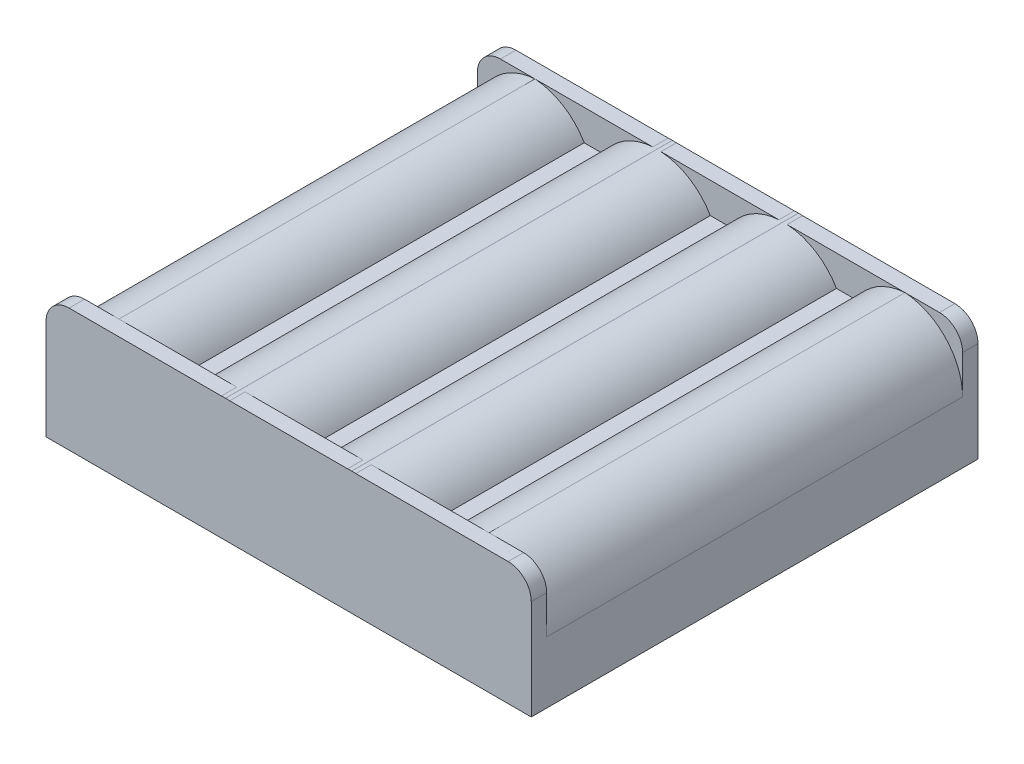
ISO-10303-21;
HEADER;
FILE_DESCRIPTION(('STEP AP214'),'2;1');
FILE_NAME('part.step','',(''),(''),'','','');
FILE_SCHEMA(('AUTOMOTIVE_DESIGN { 1 0 10303 214 1 1 1 1 }'));
ENDSEC;
DATA;
#1=APPLICATION_CONTEXT('core data for automotive mechanical design processes');
#2=APPLICATION_PROTOCOL_DEFINITION('international standard','automotive_design',2000,#1);
#3=PRODUCT_CONTEXT('',#1,'mechanical');
#4=PRODUCT('Part','Part','',(#3));
#5=PRODUCT_RELATED_PRODUCT_CATEGORY('part','',(#4));
#6=PRODUCT_DEFINITION_FORMATION('','',#4);
#7=PRODUCT_DEFINITION_CONTEXT('part definition',#1,'design');
#8=PRODUCT_DEFINITION('design','',#6,#7);
#9=PRODUCT_DEFINITION_SHAPE('','',#8);
#10=(LENGTH_UNIT() NAMED_UNIT(*) SI_UNIT(.MILLI.,.METRE.));
#11=(NAMED_UNIT(*) PLANE_ANGLE_UNIT() SI_UNIT($,.RADIAN.));
#12=(NAMED_UNIT(*) SI_UNIT($,.STERADIAN.) SOLID_ANGLE_UNIT());
#13=UNCERTAINTY_MEASURE_WITH_UNIT(LENGTH_MEASURE(1.E-05),#10,'distance_accuracy_value','');
#14=(GEOMETRIC_REPRESENTATION_CONTEXT(3) GLOBAL_UNCERTAINTY_ASSIGNED_CONTEXT((#13)) GLOBAL_UNIT_ASSIGNED_CONTEXT((#10,
#11,#12)) REPRESENTATION_CONTEXT('',''));
#15=CARTESIAN_POINT('',(0.,0.,0.));
#16=DIRECTION('',(0.,0.,1.));
#17=DIRECTION('',(1.,0.,0.));
#18=AXIS2_PLACEMENT_3D('',#15,#16,#17);
#19=CARTESIAN_POINT('',(8.19679676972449,8.,29.));
#20=DIRECTION('',(0.,0.,-1.));
#21=DIRECTION('',(-1.,0.,0.));
#22=AXIS2_PLACEMENT_3D('',#19,#20,#21);
#23=CYLINDRICAL_SURFACE('',#22,8.);
#24=CARTESIAN_POINT('',(8.19679676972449,8.,-27.));
#25=DIRECTION('',(0.,0.,1.));
#26=DIRECTION('',(1.,0.,0.));
#27=AXIS2_PLACEMENT_3D('',#24,#25,#26);
#28=CIRCLE('',#27,8.);
#29=CARTESIAN_POINT('',(8.72339838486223,15.9826493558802,-27.));
#30=VERTEX_POINT('',#29);
#31=CARTESIAN_POINT('',(15.125,12.,-27.));
#32=VERTEX_POINT('',#31);
#33=EDGE_CURVE('E285',#30,#32,#28,.F.);
#34=ORIENTED_EDGE('',*,*,#33,.F.);
#35=DIRECTION('',(0.,0.,-1.));
#36=VECTOR('',#35,1.);
#37=CARTESIAN_POINT('',(8.72339838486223,15.9826493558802,29.));
#38=LINE('',#37,#36);
#39=CARTESIAN_POINT('',(8.72339838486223,15.9826493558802,-29.));
#40=VERTEX_POINT('',#39);
#41=EDGE_CURVE('E268',#30,#40,#38,.T.);
#42=ORIENTED_EDGE('',*,*,#41,.T.);
#43=CARTESIAN_POINT('',(8.19679676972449,8.,-29.));
#44=DIRECTION('',(0.,0.,1.));
#45=DIRECTION('',(1.,0.,0.));
#46=AXIS2_PLACEMENT_3D('',#43,#44,#45);
#47=CIRCLE('',#46,8.);
#48=CARTESIAN_POINT('',(8.19679676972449,16.,-29.));
#49=VERTEX_POINT('',#48);
#50=EDGE_CURVE('E283',#49,#40,#47,.F.);
#51=ORIENTED_EDGE('',*,*,#50,.F.);
#52=DIRECTION('',(0.,0.,1.));
#53=VECTOR('',#52,1.);
#54=CARTESIAN_POINT('',(8.19679676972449,16.,-29.));
#55=LINE('',#54,#53);
#56=CARTESIAN_POINT('',(8.19679676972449,16.,29.));
#57=VERTEX_POINT('',#56);
#58=EDGE_CURVE('E323',#57,#49,#55,.F.);
#59=ORIENTED_EDGE('',*,*,#58,.F.);
#60=CARTESIAN_POINT('',(8.19679676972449,8.,29.));
#61=DIRECTION('',(0.,0.,-1.));
#62=DIRECTION('',(-1.,0.,0.));
#63=AXIS2_PLACEMENT_3D('',#60,#61,#62);
#64=CIRCLE('',#63,8.);
#65=CARTESIAN_POINT('',(8.72339838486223,15.9826493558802,29.));
#66=VERTEX_POINT('',#65);
#67=EDGE_CURVE('E317',#66,#57,#64,.F.);
#68=ORIENTED_EDGE('',*,*,#67,.F.);
#69=DIRECTION('',(0.,0.,-1.));
#70=VECTOR('',#69,1.);
#71=CARTESIAN_POINT('',(8.72339838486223,15.9826493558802,29.));
#72=LINE('',#71,#70);
#73=CARTESIAN_POINT('',(8.72339838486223,15.9826493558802,27.));
#74=VERTEX_POINT('',#73);
#75=EDGE_CURVE('E475',#74,#66,#72,.F.);
#76=ORIENTED_EDGE('',*,*,#75,.F.);
#77=CARTESIAN_POINT('',(8.19679676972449,8.,27.));
#78=DIRECTION('',(0.,0.,-1.));
#79=DIRECTION('',(-1.,0.,0.));
#80=AXIS2_PLACEMENT_3D('',#77,#78,#79);
#81=CIRCLE('',#80,8.);
#82=CARTESIAN_POINT('',(15.125,12.,27.));
#83=VERTEX_POINT('',#82);
#84=EDGE_CURVE('E451',#83,#74,#81,.F.);
#85=ORIENTED_EDGE('',*,*,#84,.F.);
#86=DIRECTION('',(0.,0.,1.));
#87=VECTOR('',#86,1.);
#88=CARTESIAN_POINT('',(15.125,12.,29.));
#89=LINE('',#88,#87);
#90=EDGE_CURVE('E492',#32,#83,#89,.T.);
#91=ORIENTED_EDGE('',*,*,#90,.F.);
#92=EDGE_LOOP('',(#34,#42,#51,#59,#68,#76,#85,#91));
#93=FACE_BOUND('',#92,.T.);
#94=ADVANCED_FACE('F51',(#93),#23,.T.);
#95=CARTESIAN_POINT('',(8.17820323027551,8.,29.));
#96=DIRECTION('',(0.,0.,1.));
#97=DIRECTION('',(1.,0.,0.));
#98=AXIS2_PLACEMENT_3D('',#95,#96,#97);
#99=CYLINDRICAL_SURFACE('',#98,8.);
#100=CARTESIAN_POINT('',(8.17820323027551,8.,-29.));
#101=DIRECTION('',(0.,0.,1.));
#102=DIRECTION('',(1.,0.,0.));
#103=AXIS2_PLACEMENT_3D('',#100,#101,#102);
#104=CIRCLE('',#103,8.);
#105=CARTESIAN_POINT('',(7.65160161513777,15.9826493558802,-29.));
#106=VERTEX_POINT('',#105);
#107=CARTESIAN_POINT('',(8.17820323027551,16.,-29.));
#108=VERTEX_POINT('',#107);
#109=EDGE_CURVE('E296',#106,#108,#104,.F.);
#110=ORIENTED_EDGE('',*,*,#109,.F.);
#111=DIRECTION('',(0.,0.,1.));
#112=VECTOR('',#111,1.);
#113=CARTESIAN_POINT('',(7.65160161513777,15.9826493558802,29.));
#114=LINE('',#113,#112);
#115=CARTESIAN_POINT('',(7.65160161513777,15.9826493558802,-27.));
#116=VERTEX_POINT('',#115);
#117=EDGE_CURVE('E288',#106,#116,#114,.T.);
#118=ORIENTED_EDGE('',*,*,#117,.T.);
#119=CARTESIAN_POINT('',(8.17820323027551,8.,-27.));
#120=DIRECTION('',(0.,0.,1.));
#121=DIRECTION('',(1.,0.,0.));
#122=AXIS2_PLACEMENT_3D('',#119,#120,#121);
#123=CIRCLE('',#122,8.);
#124=CARTESIAN_POINT('',(1.25,12.,-27.));
#125=VERTEX_POINT('',#124);
#126=EDGE_CURVE('E583',#125,#116,#123,.F.);
#127=ORIENTED_EDGE('',*,*,#126,.F.);
#128=DIRECTION('',(0.,0.,-1.));
#129=VECTOR('',#128,1.);
#130=CARTESIAN_POINT('',(1.25,12.,29.));
#131=LINE('',#130,#129);
#132=CARTESIAN_POINT('',(1.25,12.,27.));
#133=VERTEX_POINT('',#132);
#134=EDGE_CURVE('E488',#133,#125,#131,.T.);
#135=ORIENTED_EDGE('',*,*,#134,.F.);
#136=CARTESIAN_POINT('',(8.17820323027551,8.,27.));
#137=DIRECTION('',(0.,0.,-1.));
#138=DIRECTION('',(-1.,0.,0.));
#139=AXIS2_PLACEMENT_3D('',#136,#137,#138);
#140=CIRCLE('',#139,8.);
#141=CARTESIAN_POINT('',(7.65160161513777,15.9826493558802,27.));
#142=VERTEX_POINT('',#141);
#143=EDGE_CURVE('E448',#142,#133,#140,.F.);
#144=ORIENTED_EDGE('',*,*,#143,.F.);
#145=DIRECTION('',(0.,0.,1.));
#146=VECTOR('',#145,1.);
#147=CARTESIAN_POINT('',(7.65160161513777,15.9826493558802,29.));
#148=LINE('',#147,#146);
#149=CARTESIAN_POINT('',(7.65160161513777,15.9826493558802,29.));
#150=VERTEX_POINT('',#149);
#151=EDGE_CURVE('E472',#150,#142,#148,.F.);
#152=ORIENTED_EDGE('',*,*,#151,.F.);
#153=CARTESIAN_POINT('',(8.17820323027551,8.,29.));
#154=DIRECTION('',(0.,0.,-1.));
#155=DIRECTION('',(-1.,0.,0.));
#156=AXIS2_PLACEMENT_3D('',#153,#154,#155);
#157=CIRCLE('',#156,8.);
#158=CARTESIAN_POINT('',(8.17820323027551,16.,29.));
#159=VERTEX_POINT('',#158);
#160=EDGE_CURVE('E313',#159,#150,#157,.F.);
#161=ORIENTED_EDGE('',*,*,#160,.F.);
#162=DIRECTION('',(0.,0.,-1.));
#163=VECTOR('',#162,1.);
#164=CARTESIAN_POINT('',(8.17820323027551,16.,29.));
#165=LINE('',#164,#163);
#166=EDGE_CURVE('E320',#108,#159,#165,.F.);
#167=ORIENTED_EDGE('',*,*,#166,.F.);
#168=EDGE_LOOP('',(#110,#118,#127,#135,#144,#152,#161,#167));
#169=FACE_BOUND('',#168,.T.);
#170=ADVANCED_FACE('F696',(#169),#99,.T.);
#171=CARTESIAN_POINT('',(-8.17820323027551,8.,29.));
#172=DIRECTION('',(0.,0.,-1.));
#173=DIRECTION('',(-1.,0.,0.));
#174=AXIS2_PLACEMENT_3D('',#171,#172,#173);
#175=CYLINDRICAL_SURFACE('',#174,8.);
#176=CARTESIAN_POINT('',(-8.17820323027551,8.,-27.));
#177=DIRECTION('',(0.,0.,1.));
#178=DIRECTION('',(1.,0.,0.));
#179=AXIS2_PLACEMENT_3D('',#176,#177,#178);
#180=CIRCLE('',#179,8.);
#181=CARTESIAN_POINT('',(-7.65160161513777,15.9826493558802,-27.));
#182=VERTEX_POINT('',#181);
#183=CARTESIAN_POINT('',(-1.25,12.,-27.));
#184=VERTEX_POINT('',#183);
#185=EDGE_CURVE('E558',#182,#184,#180,.F.);
#186=ORIENTED_EDGE('',*,*,#185,.F.);
#187=DIRECTION('',(0.,0.,-1.));
#188=VECTOR('',#187,1.);
#189=CARTESIAN_POINT('',(-7.65160161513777,15.9826493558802,29.));
#190=LINE('',#189,#188);
#191=CARTESIAN_POINT('',(-7.65160161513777,15.9826493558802,-29.));
#192=VERTEX_POINT('',#191);
#193=EDGE_CURVE('E556',#182,#192,#190,.T.);
#194=ORIENTED_EDGE('',*,*,#193,.T.);
#195=CARTESIAN_POINT('',(-8.17820323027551,8.,-29.));
#196=DIRECTION('',(0.,0.,1.));
#197=DIRECTION('',(1.,0.,0.));
#198=AXIS2_PLACEMENT_3D('',#195,#196,#197);
#199=CIRCLE('',#198,8.);
#200=CARTESIAN_POINT('',(-8.17820323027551,16.,-29.));
#201=VERTEX_POINT('',#200);
#202=EDGE_CURVE('E303',#201,#192,#199,.F.);
#203=ORIENTED_EDGE('',*,*,#202,.F.);
#204=DIRECTION('',(0.,0.,1.));
#205=VECTOR('',#204,1.);
#206=CARTESIAN_POINT('',(-8.17820323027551,16.,-29.));
#207=LINE('',#206,#205);
#208=CARTESIAN_POINT('',(-8.17820323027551,16.,29.));
#209=VERTEX_POINT('',#208);
#210=EDGE_CURVE('E329',#209,#201,#207,.F.);
#211=ORIENTED_EDGE('',*,*,#210,.F.);
#212=CARTESIAN_POINT('',(-8.17820323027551,8.,29.));
#213=DIRECTION('',(0.,0.,-1.));
#214=DIRECTION('',(-1.,0.,0.));
#215=AXIS2_PLACEMENT_3D('',#212,#213,#214);
#216=CIRCLE('',#215,8.);
#217=CARTESIAN_POINT('',(-7.65160161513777,15.9826493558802,29.));
#218=VERTEX_POINT('',#217);
#219=EDGE_CURVE('E310',#218,#209,#216,.F.);
#220=ORIENTED_EDGE('',*,*,#219,.F.);
#221=DIRECTION('',(0.,0.,-1.));
#222=VECTOR('',#221,1.);
#223=CARTESIAN_POINT('',(-7.65160161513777,15.9826493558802,29.));
#224=LINE('',#223,#222);
#225=CARTESIAN_POINT('',(-7.65160161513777,15.9826493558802,27.));
#226=VERTEX_POINT('',#225);
#227=EDGE_CURVE('E468',#226,#218,#224,.F.);
#228=ORIENTED_EDGE('',*,*,#227,.F.);
#229=CARTESIAN_POINT('',(-8.17820323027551,8.,27.));
#230=DIRECTION('',(0.,0.,-1.));
#231=DIRECTION('',(-1.,0.,0.));
#232=AXIS2_PLACEMENT_3D('',#229,#230,#231);
#233=CIRCLE('',#232,8.);
#234=CARTESIAN_POINT('',(-1.25,12.,27.));
#235=VERTEX_POINT('',#234);
#236=EDGE_CURVE('E441',#235,#226,#233,.F.);
#237=ORIENTED_EDGE('',*,*,#236,.F.);
#238=DIRECTION('',(0.,0.,1.));
#239=VECTOR('',#238,1.);
#240=CARTESIAN_POINT('',(-1.25,12.,29.));
#241=LINE('',#240,#239);
#242=EDGE_CURVE('E483',#184,#235,#241,.T.);
#243=ORIENTED_EDGE('',*,*,#242,.F.);
#244=EDGE_LOOP('',(#186,#194,#203,#211,#220,#228,#237,#243));
#245=FACE_BOUND('',#244,.T.);
#246=ADVANCED_FACE('F554',(#245),#175,.T.);
#247=CARTESIAN_POINT('',(-8.19679676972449,8.,29.));
#248=DIRECTION('',(0.,0.,1.));
#249=DIRECTION('',(1.,0.,0.));
#250=AXIS2_PLACEMENT_3D('',#247,#248,#249);
#251=CYLINDRICAL_SURFACE('',#250,8.);
#252=CARTESIAN_POINT('',(-8.19679676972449,8.,-29.));
#253=DIRECTION('',(0.,0.,1.));
#254=DIRECTION('',(1.,0.,0.));
#255=AXIS2_PLACEMENT_3D('',#252,#253,#254);
#256=CIRCLE('',#255,8.);
#257=CARTESIAN_POINT('',(-8.72339838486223,15.9826493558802,-29.));
#258=VERTEX_POINT('',#257);
#259=CARTESIAN_POINT('',(-8.19679676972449,16.,-29.));
#260=VERTEX_POINT('',#259);
#261=EDGE_CURVE('E541',#258,#260,#256,.F.);
#262=ORIENTED_EDGE('',*,*,#261,.F.);
#263=DIRECTION('',(0.,0.,1.));
#264=VECTOR('',#263,1.);
#265=CARTESIAN_POINT('',(-8.72339838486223,15.9826493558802,29.));
#266=LINE('',#265,#264);
#267=CARTESIAN_POINT('',(-8.72339838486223,15.9826493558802,-27.));
#268=VERTEX_POINT('',#267);
#269=EDGE_CURVE('E563',#258,#268,#266,.T.);
#270=ORIENTED_EDGE('',*,*,#269,.T.);
#271=CARTESIAN_POINT('',(-8.19679676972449,8.,-27.));
#272=DIRECTION('',(0.,0.,1.));
#273=DIRECTION('',(1.,0.,0.));
#274=AXIS2_PLACEMENT_3D('',#271,#272,#273);
#275=CIRCLE('',#274,8.);
#276=CARTESIAN_POINT('',(-15.125,12.,-27.));
#277=VERTEX_POINT('',#276);
#278=EDGE_CURVE('E591',#277,#268,#275,.F.);
#279=ORIENTED_EDGE('',*,*,#278,.F.);
#280=DIRECTION('',(0.,0.,-1.));
#281=VECTOR('',#280,1.);
#282=CARTESIAN_POINT('',(-15.125,12.,29.));
#283=LINE('',#282,#281);
#284=CARTESIAN_POINT('',(-15.125,12.,27.));
#285=VERTEX_POINT('',#284);
#286=EDGE_CURVE('E482',#285,#277,#283,.T.);
#287=ORIENTED_EDGE('',*,*,#286,.F.);
#288=CARTESIAN_POINT('',(-8.19679676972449,8.,27.));
#289=DIRECTION('',(0.,0.,-1.));
#290=DIRECTION('',(-1.,0.,0.));
#291=AXIS2_PLACEMENT_3D('',#288,#289,#290);
#292=CIRCLE('',#291,8.);
#293=CARTESIAN_POINT('',(-8.72339838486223,15.9826493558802,27.));
#294=VERTEX_POINT('',#293);
#295=EDGE_CURVE('E436',#294,#285,#292,.F.);
#296=ORIENTED_EDGE('',*,*,#295,.F.);
#297=DIRECTION('',(0.,0.,1.));
#298=VECTOR('',#297,1.);
#299=CARTESIAN_POINT('',(-8.72339838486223,15.9826493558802,29.));
#300=LINE('',#299,#298);
#301=CARTESIAN_POINT('',(-8.72339838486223,15.9826493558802,29.));
#302=VERTEX_POINT('',#301);
#303=EDGE_CURVE('E465',#302,#294,#300,.F.);
#304=ORIENTED_EDGE('',*,*,#303,.F.);
#305=CARTESIAN_POINT('',(-8.19679676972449,8.,29.));
#306=DIRECTION('',(0.,0.,-1.));
#307=DIRECTION('',(-1.,0.,0.));
#308=AXIS2_PLACEMENT_3D('',#305,#306,#307);
#309=CIRCLE('',#308,8.);
#310=CARTESIAN_POINT('',(-8.19679676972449,16.,29.));
#311=VERTEX_POINT('',#310);
#312=EDGE_CURVE('E301',#311,#302,#309,.F.);
#313=ORIENTED_EDGE('',*,*,#312,.F.);
#314=DIRECTION('',(0.,0.,-1.));
#315=VECTOR('',#314,1.);
#316=CARTESIAN_POINT('',(-8.19679676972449,16.,29.));
#317=LINE('',#316,#315);
#318=EDGE_CURVE('E326',#260,#311,#317,.F.);
#319=ORIENTED_EDGE('',*,*,#318,.F.);
#320=EDGE_LOOP('',(#262,#270,#279,#287,#296,#304,#313,#319));
#321=FACE_BOUND('',#320,.T.);
#322=ADVANCED_FACE('F680',(#321),#251,.T.);
#323=CARTESIAN_POINT('',(0.,16.,0.));
#324=DIRECTION('',(0.,1.,0.));
#325=DIRECTION('',(0.,0.,1.));
#326=AXIS2_PLACEMENT_3D('',#323,#324,#325);
#327=PLANE('',#326);
#328=DIRECTION('',(1.,0.,0.));
#329=VECTOR('',#328,1.);
#330=CARTESIAN_POINT('',(31.5,16.,29.));
#331=LINE('',#330,#329);
#332=EDGE_CURVE('E500',#311,#209,#331,.T.);
#333=ORIENTED_EDGE('',*,*,#332,.T.);
#334=ORIENTED_EDGE('',*,*,#210,.T.);
#335=DIRECTION('',(-1.,0.,0.));
#336=VECTOR('',#335,1.);
#337=CARTESIAN_POINT('',(31.5,16.,-29.));
#338=LINE('',#337,#336);
#339=EDGE_CURVE('E504',#201,#260,#338,.T.);
#340=ORIENTED_EDGE('',*,*,#339,.T.);
#341=ORIENTED_EDGE('',*,*,#318,.T.);
#342=EDGE_LOOP('',(#333,#334,#340,#341));
#343=FACE_BOUND('',#342,.T.);
#344=ADVANCED_FACE('F685',(#343),#327,.T.);
#345=EDGE_CURVE('E505',#159,#57,#331,.T.);
#346=ORIENTED_EDGE('',*,*,#345,.T.);
#347=ORIENTED_EDGE('',*,*,#58,.T.);
#348=EDGE_CURVE('E293',#49,#108,#338,.T.);
#349=ORIENTED_EDGE('',*,*,#348,.T.);
#350=ORIENTED_EDGE('',*,*,#166,.T.);
#351=EDGE_LOOP('',(#346,#347,#349,#350));
#352=FACE_BOUND('',#351,.T.);
#353=ADVANCED_FACE('F691',(#352),#327,.T.);
#354=CARTESIAN_POINT('',(-31.5,16.,29.));
#355=DIRECTION('',(1.,0.,0.));
#356=DIRECTION('',(0.,0.,-1.));
#357=AXIS2_PLACEMENT_3D('',#354,#355,#356);
#358=PLANE('',#357);
#359=DIRECTION('',(0.,-1.,0.));
#360=VECTOR('',#359,1.);
#361=CARTESIAN_POINT('',(-31.5,0.,-27.));
#362=LINE('',#361,#360);
#363=CARTESIAN_POINT('',(-31.5,12.9826493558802,-27.));
#364=VERTEX_POINT('',#363);
#365=CARTESIAN_POINT('',(-31.5,8.,-27.));
#366=VERTEX_POINT('',#365);
#367=EDGE_CURVE('E275',#364,#366,#362,.T.);
#368=ORIENTED_EDGE('',*,*,#367,.F.);
#369=DIRECTION('',(0.,0.,-1.));
#370=VECTOR('',#369,1.);
#371=CARTESIAN_POINT('',(-31.5,12.9826493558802,29.));
#372=LINE('',#371,#370);
#373=CARTESIAN_POINT('',(-31.5,12.9826493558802,-29.));
#374=VERTEX_POINT('',#373);
#375=EDGE_CURVE('E375',#364,#374,#372,.T.);
#376=ORIENTED_EDGE('',*,*,#375,.T.);
#377=DIRECTION('',(0.,-1.,0.));
#378=VECTOR('',#377,1.);
#379=CARTESIAN_POINT('',(-31.5,16.,-29.));
#380=LINE('',#379,#378);
#381=CARTESIAN_POINT('',(-31.5,0.,-29.));
#382=VERTEX_POINT('',#381);
#383=EDGE_CURVE('E508',#374,#382,#380,.T.);
#384=ORIENTED_EDGE('',*,*,#383,.T.);
#385=DIRECTION('',(0.,0.,1.));
#386=VECTOR('',#385,1.);
#387=CARTESIAN_POINT('',(-31.5,0.,29.));
#388=LINE('',#387,#386);
#389=CARTESIAN_POINT('',(-31.5,0.,29.));
#390=VERTEX_POINT('',#389);
#391=EDGE_CURVE('E487',#382,#390,#388,.T.);
#392=ORIENTED_EDGE('',*,*,#391,.T.);
#393=DIRECTION('',(0.,-1.,0.));
#394=VECTOR('',#393,1.);
#395=CARTESIAN_POINT('',(-31.5,16.,29.));
#396=LINE('',#395,#394);
#397=CARTESIAN_POINT('',(-31.5,12.9826493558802,29.));
#398=VERTEX_POINT('',#397);
#399=EDGE_CURVE('E532',#398,#390,#396,.T.);
#400=ORIENTED_EDGE('',*,*,#399,.F.);
#401=DIRECTION('',(0.,0.,1.));
#402=VECTOR('',#401,1.);
#403=CARTESIAN_POINT('',(-31.5,12.9826493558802,27.));
#404=LINE('',#403,#402);
#405=CARTESIAN_POINT('',(-31.5,12.9826493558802,27.));
#406=VERTEX_POINT('',#405);
#407=EDGE_CURVE('E372',#398,#406,#404,.F.);
#408=ORIENTED_EDGE('',*,*,#407,.T.);
#409=DIRECTION('',(0.,-1.,0.));
#410=VECTOR('',#409,1.);
#411=CARTESIAN_POINT('',(-31.5,0.,27.));
#412=LINE('',#411,#410);
#413=CARTESIAN_POINT('',(-31.5,8.,27.));
#414=VERTEX_POINT('',#413);
#415=EDGE_CURVE('E422',#406,#414,#412,.T.);
#416=ORIENTED_EDGE('',*,*,#415,.T.);
#417=DIRECTION('',(0.,0.,1.));
#418=VECTOR('',#417,1.);
#419=CARTESIAN_POINT('',(-31.5,8.,-29.));
#420=LINE('',#419,#418);
#421=EDGE_CURVE('E538',#414,#366,#420,.F.);
#422=ORIENTED_EDGE('',*,*,#421,.T.);
#423=EDGE_LOOP('',(#368,#376,#384,#392,#400,#408,#416,#422));
#424=FACE_BOUND('',#423,.T.);
#425=ADVANCED_FACE('F754',(#424),#358,.F.);
#426=CARTESIAN_POINT('',(31.5,16.,29.));
#427=DIRECTION('',(0.,0.,-1.));
#428=DIRECTION('',(-1.,0.,0.));
#429=AXIS2_PLACEMENT_3D('',#426,#427,#428);
#430=PLANE('',#429);
#431=DIRECTION('',(0.,-1.,0.));
#432=VECTOR('',#431,1.);
#433=CARTESIAN_POINT('',(31.5,16.,29.));
#434=LINE('',#433,#432);
#435=CARTESIAN_POINT('',(31.5,12.9826493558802,29.));
#436=VERTEX_POINT('',#435);
#437=CARTESIAN_POINT('',(31.5,0.,29.));
#438=VERTEX_POINT('',#437);
#439=EDGE_CURVE('E529',#436,#438,#434,.T.);
#440=ORIENTED_EDGE('',*,*,#439,.F.);
#441=CARTESIAN_POINT('',(28.5,12.9826493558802,29.));
#442=DIRECTION('',(0.,0.,-1.));
#443=DIRECTION('',(-1.,0.,0.));
#444=AXIS2_PLACEMENT_3D('',#441,#442,#443);
#445=CIRCLE('',#444,3.);
#446=CARTESIAN_POINT('',(28.5,15.9826493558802,29.));
#447=VERTEX_POINT('',#446);
#448=EDGE_CURVE('E352',#436,#447,#445,.F.);
#449=ORIENTED_EDGE('',*,*,#448,.T.);
#450=DIRECTION('',(-1.,0.,0.));
#451=VECTOR('',#450,1.);
#452=CARTESIAN_POINT('',(-31.5,15.9826493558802,29.));
#453=LINE('',#452,#451);
#454=EDGE_CURVE('E402',#447,#66,#453,.T.);
#455=ORIENTED_EDGE('',*,*,#454,.T.);
#456=ORIENTED_EDGE('',*,*,#67,.T.);
#457=ORIENTED_EDGE('',*,*,#345,.F.);
#458=ORIENTED_EDGE('',*,*,#160,.T.);
#459=EDGE_CURVE('E400',#150,#218,#453,.T.);
#460=ORIENTED_EDGE('',*,*,#459,.T.);
#461=ORIENTED_EDGE('',*,*,#219,.T.);
#462=ORIENTED_EDGE('',*,*,#332,.F.);
#463=ORIENTED_EDGE('',*,*,#312,.T.);
#464=CARTESIAN_POINT('',(-28.5,15.9826493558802,29.));
#465=VERTEX_POINT('',#464);
#466=EDGE_CURVE('E287',#302,#465,#453,.T.);
#467=ORIENTED_EDGE('',*,*,#466,.T.);
#468=CARTESIAN_POINT('',(-28.5,12.9826493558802,29.));
#469=DIRECTION('',(0.,0.,-1.));
#470=DIRECTION('',(-1.,0.,0.));
#471=AXIS2_PLACEMENT_3D('',#468,#469,#470);
#472=CIRCLE('',#471,3.);
#473=EDGE_CURVE('E349',#465,#398,#472,.F.);
#474=ORIENTED_EDGE('',*,*,#473,.T.);
#475=ORIENTED_EDGE('',*,*,#399,.T.);
#476=DIRECTION('',(1.,0.,0.));
#477=VECTOR('',#476,1.);
#478=CARTESIAN_POINT('',(31.5,0.,29.));
#479=LINE('',#478,#477);
#480=EDGE_CURVE('E512',#390,#438,#479,.T.);
#481=ORIENTED_EDGE('',*,*,#480,.T.);
#482=EDGE_LOOP('',(#440,#449,#455,#456,#457,#458,#460,#461,#462,#463,#467,#474,#475,#481));
#483=FACE_BOUND('',#482,.T.);
#484=ADVANCED_FACE('F395',(#483),#430,.F.);
#485=CARTESIAN_POINT('',(31.5,16.,29.));
#486=DIRECTION('',(-1.,0.,0.));
#487=DIRECTION('',(0.,0.,1.));
#488=AXIS2_PLACEMENT_3D('',#485,#486,#487);
#489=PLANE('',#488);
#490=DIRECTION('',(0.,1.,0.));
#491=VECTOR('',#490,1.);
#492=CARTESIAN_POINT('',(31.5,15.9826493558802,27.));
#493=LINE('',#492,#491);
#494=CARTESIAN_POINT('',(31.5,8.,27.));
#495=VERTEX_POINT('',#494);
#496=CARTESIAN_POINT('',(31.5,12.9826493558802,27.));
#497=VERTEX_POINT('',#496);
#498=EDGE_CURVE('E407',#495,#497,#493,.T.);
#499=ORIENTED_EDGE('',*,*,#498,.T.);
#500=DIRECTION('',(0.,0.,1.));
#501=VECTOR('',#500,1.);
#502=CARTESIAN_POINT('',(31.5,12.9826493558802,29.));
#503=LINE('',#502,#501);
#504=EDGE_CURVE('E345',#497,#436,#503,.T.);
#505=ORIENTED_EDGE('',*,*,#504,.T.);
#506=ORIENTED_EDGE('',*,*,#439,.T.);
#507=DIRECTION('',(0.,0.,-1.));
#508=VECTOR('',#507,1.);
#509=CARTESIAN_POINT('',(31.5,0.,29.));
#510=LINE('',#509,#508);
#511=CARTESIAN_POINT('',(31.5,0.,-29.));
#512=VERTEX_POINT('',#511);
#513=EDGE_CURVE('E516',#438,#512,#510,.T.);
#514=ORIENTED_EDGE('',*,*,#513,.T.);
#515=DIRECTION('',(0.,-1.,0.));
#516=VECTOR('',#515,1.);
#517=CARTESIAN_POINT('',(31.5,16.,-29.));
#518=LINE('',#517,#516);
#519=CARTESIAN_POINT('',(31.5,12.9826493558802,-29.));
#520=VERTEX_POINT('',#519);
#521=EDGE_CURVE('E526',#520,#512,#518,.T.);
#522=ORIENTED_EDGE('',*,*,#521,.F.);
#523=DIRECTION('',(0.,0.,-1.));
#524=VECTOR('',#523,1.);
#525=CARTESIAN_POINT('',(31.5,12.9826493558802,29.));
#526=LINE('',#525,#524);
#527=CARTESIAN_POINT('',(31.5,12.9826493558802,-27.));
#528=VERTEX_POINT('',#527);
#529=EDGE_CURVE('E342',#520,#528,#526,.F.);
#530=ORIENTED_EDGE('',*,*,#529,.T.);
#531=DIRECTION('',(0.,1.,0.));
#532=VECTOR('',#531,1.);
#533=CARTESIAN_POINT('',(31.5,15.9826493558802,-27.));
#534=LINE('',#533,#532);
#535=CARTESIAN_POINT('',(31.5,8.,-27.));
#536=VERTEX_POINT('',#535);
#537=EDGE_CURVE('E599',#536,#528,#534,.T.);
#538=ORIENTED_EDGE('',*,*,#537,.F.);
#539=DIRECTION('',(0.,0.,-1.));
#540=VECTOR('',#539,1.);
#541=CARTESIAN_POINT('',(31.5,8.,29.));
#542=LINE('',#541,#540);
#543=EDGE_CURVE('E535',#536,#495,#542,.F.);
#544=ORIENTED_EDGE('',*,*,#543,.T.);
#545=EDGE_LOOP('',(#499,#505,#506,#514,#522,#530,#538,#544));
#546=FACE_BOUND('',#545,.T.);
#547=ADVANCED_FACE('F764',(#546),#489,.F.);
#548=CARTESIAN_POINT('',(31.5,16.,-29.));
#549=DIRECTION('',(0.,0.,1.));
#550=DIRECTION('',(1.,0.,0.));
#551=AXIS2_PLACEMENT_3D('',#548,#549,#550);
#552=PLANE('',#551);
#553=DIRECTION('',(-1.,0.,0.));
#554=VECTOR('',#553,1.);
#555=CARTESIAN_POINT('',(24.0266016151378,15.9826493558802,-29.));
#556=LINE('',#555,#554);
#557=CARTESIAN_POINT('',(28.5,15.9826493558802,-29.));
#558=VERTEX_POINT('',#557);
#559=EDGE_CURVE('E263',#558,#40,#556,.T.);
#560=ORIENTED_EDGE('',*,*,#559,.F.);
#561=CARTESIAN_POINT('',(28.5,12.9826493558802,-29.));
#562=DIRECTION('',(0.,0.,1.));
#563=DIRECTION('',(1.,0.,0.));
#564=AXIS2_PLACEMENT_3D('',#561,#562,#563);
#565=CIRCLE('',#564,3.);
#566=EDGE_CURVE('E366',#558,#520,#565,.F.);
#567=ORIENTED_EDGE('',*,*,#566,.T.);
#568=ORIENTED_EDGE('',*,*,#521,.T.);
#569=DIRECTION('',(-1.,0.,0.));
#570=VECTOR('',#569,1.);
#571=CARTESIAN_POINT('',(31.5,0.,-29.));
#572=LINE('',#571,#570);
#573=EDGE_CURVE('E520',#512,#382,#572,.T.);
#574=ORIENTED_EDGE('',*,*,#573,.T.);
#575=ORIENTED_EDGE('',*,*,#383,.F.);
#576=CARTESIAN_POINT('',(-28.5,12.9826493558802,-29.));
#577=DIRECTION('',(0.,0.,1.));
#578=DIRECTION('',(1.,0.,0.));
#579=AXIS2_PLACEMENT_3D('',#576,#577,#578);
#580=CIRCLE('',#579,3.);
#581=CARTESIAN_POINT('',(-28.5,15.9826493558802,-29.));
#582=VERTEX_POINT('',#581);
#583=EDGE_CURVE('E363',#374,#582,#580,.F.);
#584=ORIENTED_EDGE('',*,*,#583,.T.);
#585=EDGE_CURVE('E278',#258,#582,#556,.T.);
#586=ORIENTED_EDGE('',*,*,#585,.F.);
#587=ORIENTED_EDGE('',*,*,#261,.T.);
#588=ORIENTED_EDGE('',*,*,#339,.F.);
#589=ORIENTED_EDGE('',*,*,#202,.T.);
#590=EDGE_CURVE('E276',#106,#192,#556,.T.);
#591=ORIENTED_EDGE('',*,*,#590,.F.);
#592=ORIENTED_EDGE('',*,*,#109,.T.);
#593=ORIENTED_EDGE('',*,*,#348,.F.);
#594=ORIENTED_EDGE('',*,*,#50,.T.);
#595=EDGE_LOOP('',(#560,#567,#568,#574,#575,#584,#586,#587,#588,#589,#591,#592,#593,#594));
#596=FACE_BOUND('',#595,.T.);
#597=ADVANCED_FACE('F291',(#596),#552,.F.);
#598=CARTESIAN_POINT('',(0.,0.,0.));
#599=DIRECTION('',(0.,1.,0.));
#600=DIRECTION('',(0.,0.,1.));
#601=AXIS2_PLACEMENT_3D('',#598,#599,#600);
#602=PLANE('',#601);
#603=ORIENTED_EDGE('',*,*,#480,.F.);
#604=ORIENTED_EDGE('',*,*,#391,.F.);
#605=ORIENTED_EDGE('',*,*,#573,.F.);
#606=ORIENTED_EDGE('',*,*,#513,.F.);
#607=EDGE_LOOP('',(#603,#604,#605,#606));
#608=FACE_BOUND('',#607,.T.);
#609=ADVANCED_FACE('F762',(#608),#602,.F.);
#610=CARTESIAN_POINT('',(23.5,8.,0.));
#611=DIRECTION('',(0.,0.,1.));
#612=DIRECTION('',(1.,0.,0.));
#613=AXIS2_PLACEMENT_3D('',#610,#611,#612);
#614=CYLINDRICAL_SURFACE('',#613,8.);
#615=CARTESIAN_POINT('',(23.5,8.,-27.));
#616=DIRECTION('',(0.,0.,1.));
#617=DIRECTION('',(1.,0.,0.));
#618=AXIS2_PLACEMENT_3D('',#615,#616,#617);
#619=CIRCLE('',#618,8.);
#620=CARTESIAN_POINT('',(24.0266016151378,15.9826493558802,-27.));
#621=VERTEX_POINT('',#620);
#622=EDGE_CURVE('E569',#621,#536,#619,.F.);
#623=ORIENTED_EDGE('',*,*,#622,.F.);
#624=DIRECTION('',(0.,0.,1.));
#625=VECTOR('',#624,1.);
#626=CARTESIAN_POINT('',(24.0266016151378,15.9826493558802,0.));
#627=LINE('',#626,#625);
#628=CARTESIAN_POINT('',(24.0266016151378,15.9826493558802,27.));
#629=VERTEX_POINT('',#628);
#630=EDGE_CURVE('E295',#621,#629,#627,.T.);
#631=ORIENTED_EDGE('',*,*,#630,.T.);
#632=CARTESIAN_POINT('',(23.5,8.,27.));
#633=DIRECTION('',(0.,0.,-1.));
#634=DIRECTION('',(-1.,0.,0.));
#635=AXIS2_PLACEMENT_3D('',#632,#633,#634);
#636=CIRCLE('',#635,8.);
#637=EDGE_CURVE('E461',#495,#629,#636,.F.);
#638=ORIENTED_EDGE('',*,*,#637,.F.);
#639=ORIENTED_EDGE('',*,*,#543,.F.);
#640=EDGE_LOOP('',(#623,#631,#638,#639));
#641=FACE_BOUND('',#640,.T.);
#642=ADVANCED_FACE('F633',(#641),#614,.T.);
#643=CARTESIAN_POINT('',(-23.5,8.,0.));
#644=DIRECTION('',(0.,0.,-1.));
#645=DIRECTION('',(-1.,0.,0.));
#646=AXIS2_PLACEMENT_3D('',#643,#644,#645);
#647=CYLINDRICAL_SURFACE('',#646,8.);
#648=CARTESIAN_POINT('',(-23.5,8.,-27.));
#649=DIRECTION('',(0.,0.,1.));
#650=DIRECTION('',(1.,0.,0.));
#651=AXIS2_PLACEMENT_3D('',#648,#649,#650);
#652=CIRCLE('',#651,8.);
#653=CARTESIAN_POINT('',(-24.0266016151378,15.9826493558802,-27.));
#654=VERTEX_POINT('',#653);
#655=EDGE_CURVE('E594',#366,#654,#652,.F.);
#656=ORIENTED_EDGE('',*,*,#655,.F.);
#657=ORIENTED_EDGE('',*,*,#421,.F.);
#658=CARTESIAN_POINT('',(-23.5,8.,27.));
#659=DIRECTION('',(0.,0.,-1.));
#660=DIRECTION('',(-1.,0.,0.));
#661=AXIS2_PLACEMENT_3D('',#658,#659,#660);
#662=CIRCLE('',#661,8.);
#663=CARTESIAN_POINT('',(-24.0266016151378,15.9826493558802,27.));
#664=VERTEX_POINT('',#663);
#665=EDGE_CURVE('E431',#664,#414,#662,.F.);
#666=ORIENTED_EDGE('',*,*,#665,.F.);
#667=DIRECTION('',(0.,0.,-1.));
#668=VECTOR('',#667,1.);
#669=CARTESIAN_POINT('',(-24.0266016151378,15.9826493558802,0.));
#670=LINE('',#669,#668);
#671=EDGE_CURVE('E332',#664,#654,#670,.T.);
#672=ORIENTED_EDGE('',*,*,#671,.T.);
#673=EDGE_LOOP('',(#656,#657,#666,#672));
#674=FACE_BOUND('',#673,.T.);
#675=ADVANCED_FACE('F668',(#674),#647,.T.);
#676=CARTESIAN_POINT('',(0.,12.,0.));
#677=DIRECTION('',(0.,1.,0.));
#678=DIRECTION('',(0.,0.,1.));
#679=AXIS2_PLACEMENT_3D('',#676,#677,#678);
#680=PLANE('',#679);
#681=DIRECTION('',(1.,0.,0.));
#682=VECTOR('',#681,1.);
#683=CARTESIAN_POINT('',(0.,12.,-27.));
#684=LINE('',#683,#682);
#685=CARTESIAN_POINT('',(17.625,12.,-27.));
#686=VERTEX_POINT('',#685);
#687=EDGE_CURVE('E578',#32,#686,#684,.T.);
#688=ORIENTED_EDGE('',*,*,#687,.F.);
#689=ORIENTED_EDGE('',*,*,#90,.T.);
#690=DIRECTION('',(-1.,0.,0.));
#691=VECTOR('',#690,1.);
#692=CARTESIAN_POINT('',(0.,12.,27.));
#693=LINE('',#692,#691);
#694=CARTESIAN_POINT('',(17.625,12.,27.));
#695=VERTEX_POINT('',#694);
#696=EDGE_CURVE('E454',#695,#83,#693,.T.);
#697=ORIENTED_EDGE('',*,*,#696,.F.);
#698=DIRECTION('',(0.,0.,-1.));
#699=VECTOR('',#698,1.);
#700=CARTESIAN_POINT('',(17.625,12.,29.));
#701=LINE('',#700,#699);
#702=EDGE_CURVE('E478',#695,#686,#701,.T.);
#703=ORIENTED_EDGE('',*,*,#702,.T.);
#704=EDGE_LOOP('',(#688,#689,#697,#703));
#705=FACE_BOUND('',#704,.T.);
#706=ADVANCED_FACE('F648',(#705),#680,.T.);
#707=CARTESIAN_POINT('',(0.,12.,0.));
#708=DIRECTION('',(0.,1.,0.));
#709=DIRECTION('',(0.,0.,1.));
#710=AXIS2_PLACEMENT_3D('',#707,#708,#709);
#711=PLANE('',#710);
#712=DIRECTION('',(1.,0.,0.));
#713=VECTOR('',#712,1.);
#714=CARTESIAN_POINT('',(0.,12.,-27.));
#715=LINE('',#714,#713);
#716=EDGE_CURVE('E586',#184,#125,#715,.T.);
#717=ORIENTED_EDGE('',*,*,#716,.F.);
#718=ORIENTED_EDGE('',*,*,#242,.T.);
#719=DIRECTION('',(-1.,0.,0.));
#720=VECTOR('',#719,1.);
#721=CARTESIAN_POINT('',(0.,12.,27.));
#722=LINE('',#721,#720);
#723=EDGE_CURVE('E444',#133,#235,#722,.T.);
#724=ORIENTED_EDGE('',*,*,#723,.F.);
#725=ORIENTED_EDGE('',*,*,#134,.T.);
#726=EDGE_LOOP('',(#717,#718,#724,#725));
#727=FACE_BOUND('',#726,.T.);
#728=ADVANCED_FACE('F706',(#727),#711,.T.);
#729=CARTESIAN_POINT('',(0.,12.,0.));
#730=DIRECTION('',(0.,1.,0.));
#731=DIRECTION('',(0.,0.,1.));
#732=AXIS2_PLACEMENT_3D('',#729,#730,#731);
#733=PLANE('',#732);
#734=DIRECTION('',(1.,0.,0.));
#735=VECTOR('',#734,1.);
#736=CARTESIAN_POINT('',(0.,12.,-27.));
#737=LINE('',#736,#735);
#738=CARTESIAN_POINT('',(-17.625,12.,-27.));
#739=VERTEX_POINT('',#738);
#740=EDGE_CURVE('E597',#739,#277,#737,.T.);
#741=ORIENTED_EDGE('',*,*,#740,.F.);
#742=DIRECTION('',(0.,0.,1.));
#743=VECTOR('',#742,1.);
#744=CARTESIAN_POINT('',(-17.625,12.,29.));
#745=LINE('',#744,#743);
#746=CARTESIAN_POINT('',(-17.625,12.,27.));
#747=VERTEX_POINT('',#746);
#748=EDGE_CURVE('E479',#739,#747,#745,.T.);
#749=ORIENTED_EDGE('',*,*,#748,.T.);
#750=DIRECTION('',(-1.,0.,0.));
#751=VECTOR('',#750,1.);
#752=CARTESIAN_POINT('',(0.,12.,27.));
#753=LINE('',#752,#751);
#754=EDGE_CURVE('E425',#285,#747,#753,.T.);
#755=ORIENTED_EDGE('',*,*,#754,.F.);
#756=ORIENTED_EDGE('',*,*,#286,.T.);
#757=EDGE_LOOP('',(#741,#749,#755,#756));
#758=FACE_BOUND('',#757,.T.);
#759=ADVANCED_FACE('F676',(#758),#733,.T.);
#760=CARTESIAN_POINT('',(24.5532032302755,8.,29.));
#761=DIRECTION('',(0.,0.,1.));
#762=DIRECTION('',(1.,0.,0.));
#763=AXIS2_PLACEMENT_3D('',#760,#761,#762);
#764=CYLINDRICAL_SURFACE('',#763,8.);
#765=CARTESIAN_POINT('',(24.5532032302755,8.,-27.));
#766=DIRECTION('',(0.,0.,1.));
#767=DIRECTION('',(1.,0.,0.));
#768=AXIS2_PLACEMENT_3D('',#765,#766,#767);
#769=CIRCLE('',#768,8.);
#770=EDGE_CURVE('E574',#686,#621,#769,.F.);
#771=ORIENTED_EDGE('',*,*,#770,.F.);
#772=ORIENTED_EDGE('',*,*,#702,.F.);
#773=CARTESIAN_POINT('',(24.5532032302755,8.,27.));
#774=DIRECTION('',(0.,0.,-1.));
#775=DIRECTION('',(-1.,0.,0.));
#776=AXIS2_PLACEMENT_3D('',#773,#774,#775);
#777=CIRCLE('',#776,8.);
#778=EDGE_CURVE('E458',#629,#695,#777,.F.);
#779=ORIENTED_EDGE('',*,*,#778,.F.);
#780=ORIENTED_EDGE('',*,*,#630,.F.);
#781=EDGE_LOOP('',(#771,#772,#779,#780));
#782=FACE_BOUND('',#781,.T.);
#783=ADVANCED_FACE('F639',(#782),#764,.T.);
#784=CARTESIAN_POINT('',(-24.5532032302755,8.,29.));
#785=DIRECTION('',(0.,0.,-1.));
#786=DIRECTION('',(-1.,0.,0.));
#787=AXIS2_PLACEMENT_3D('',#784,#785,#786);
#788=CYLINDRICAL_SURFACE('',#787,8.);
#789=CARTESIAN_POINT('',(-24.5532032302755,8.,-27.));
#790=DIRECTION('',(0.,0.,1.));
#791=DIRECTION('',(1.,0.,0.));
#792=AXIS2_PLACEMENT_3D('',#789,#790,#791);
#793=CIRCLE('',#792,8.);
#794=EDGE_CURVE('E339',#654,#739,#793,.F.);
#795=ORIENTED_EDGE('',*,*,#794,.F.);
#796=ORIENTED_EDGE('',*,*,#671,.F.);
#797=CARTESIAN_POINT('',(-24.5532032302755,8.,27.));
#798=DIRECTION('',(0.,0.,-1.));
#799=DIRECTION('',(-1.,0.,0.));
#800=AXIS2_PLACEMENT_3D('',#797,#798,#799);
#801=CIRCLE('',#800,8.);
#802=EDGE_CURVE('E336',#747,#664,#801,.F.);
#803=ORIENTED_EDGE('',*,*,#802,.F.);
#804=ORIENTED_EDGE('',*,*,#748,.F.);
#805=EDGE_LOOP('',(#795,#796,#803,#804));
#806=FACE_BOUND('',#805,.T.);
#807=ADVANCED_FACE('F670',(#806),#788,.T.);
#808=CARTESIAN_POINT('',(0.,0.,27.));
#809=DIRECTION('',(0.,0.,-1.));
#810=DIRECTION('',(-1.,0.,0.));
#811=AXIS2_PLACEMENT_3D('',#808,#809,#810);
#812=PLANE('',#811);
#813=ORIENTED_EDGE('',*,*,#415,.F.);
#814=CARTESIAN_POINT('',(-28.5,12.9826493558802,27.));
#815=DIRECTION('',(0.,0.,-1.));
#816=DIRECTION('',(-1.,0.,0.));
#817=AXIS2_PLACEMENT_3D('',#814,#815,#816);
#818=CIRCLE('',#817,3.);
#819=CARTESIAN_POINT('',(-28.5,15.9826493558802,27.));
#820=VERTEX_POINT('',#819);
#821=EDGE_CURVE('E11',#406,#820,#818,.T.);
#822=ORIENTED_EDGE('',*,*,#821,.T.);
#823=DIRECTION('',(-1.,0.,0.));
#824=VECTOR('',#823,1.);
#825=CARTESIAN_POINT('',(24.0266016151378,15.9826493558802,27.));
#826=LINE('',#825,#824);
#827=EDGE_CURVE('E391',#664,#820,#826,.T.);
#828=ORIENTED_EDGE('',*,*,#827,.F.);
#829=ORIENTED_EDGE('',*,*,#665,.T.);
#830=EDGE_LOOP('',(#813,#822,#828,#829));
#831=FACE_BOUND('',#830,.T.);
#832=ADVANCED_FACE('F739',(#831),#812,.T.);
#833=CARTESIAN_POINT('',(-31.5,15.9826493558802,27.));
#834=DIRECTION('',(0.,1.,0.));
#835=DIRECTION('',(0.,0.,1.));
#836=AXIS2_PLACEMENT_3D('',#833,#834,#835);
#837=PLANE('',#836);
#838=ORIENTED_EDGE('',*,*,#827,.T.);
#839=DIRECTION('',(0.,0.,1.));
#840=VECTOR('',#839,1.);
#841=CARTESIAN_POINT('',(-28.5,15.9826493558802,29.));
#842=LINE('',#841,#840);
#843=EDGE_CURVE('E60',#820,#465,#842,.T.);
#844=ORIENTED_EDGE('',*,*,#843,.T.);
#845=ORIENTED_EDGE('',*,*,#466,.F.);
#846=ORIENTED_EDGE('',*,*,#303,.T.);
#847=EDGE_CURVE('E417',#294,#664,#826,.T.);
#848=ORIENTED_EDGE('',*,*,#847,.T.);
#849=EDGE_LOOP('',(#838,#844,#845,#846,#848));
#850=FACE_BOUND('',#849,.T.);
#851=ADVANCED_FACE('F388',(#850),#837,.T.);
#852=ORIENTED_EDGE('',*,*,#847,.F.);
#853=ORIENTED_EDGE('',*,*,#295,.T.);
#854=ORIENTED_EDGE('',*,*,#754,.T.);
#855=ORIENTED_EDGE('',*,*,#802,.T.);
#856=EDGE_LOOP('',(#852,#853,#854,#855));
#857=FACE_BOUND('',#856,.T.);
#858=ADVANCED_FACE('F778',(#857),#812,.T.);
#859=EDGE_CURVE('E655',#142,#226,#826,.T.);
#860=ORIENTED_EDGE('',*,*,#859,.F.);
#861=ORIENTED_EDGE('',*,*,#143,.T.);
#862=ORIENTED_EDGE('',*,*,#723,.T.);
#863=ORIENTED_EDGE('',*,*,#236,.T.);
#864=EDGE_LOOP('',(#860,#861,#862,#863));
#865=FACE_BOUND('',#864,.T.);
#866=ADVANCED_FACE('F701',(#865),#812,.T.);
#867=ORIENTED_EDGE('',*,*,#459,.F.);
#868=ORIENTED_EDGE('',*,*,#151,.T.);
#869=ORIENTED_EDGE('',*,*,#859,.T.);
#870=ORIENTED_EDGE('',*,*,#227,.T.);
#871=EDGE_LOOP('',(#867,#868,#869,#870));
#872=FACE_BOUND('',#871,.T.);
#873=ADVANCED_FACE('F699',(#872),#837,.T.);
#874=ORIENTED_EDGE('',*,*,#454,.F.);
#875=DIRECTION('',(0.,0.,1.));
#876=VECTOR('',#875,1.);
#877=CARTESIAN_POINT('',(28.5,15.9826493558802,27.));
#878=LINE('',#877,#876);
#879=CARTESIAN_POINT('',(28.5,15.9826493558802,27.));
#880=VERTEX_POINT('',#879);
#881=EDGE_CURVE('E355',#447,#880,#878,.F.);
#882=ORIENTED_EDGE('',*,*,#881,.T.);
#883=EDGE_CURVE('E419',#880,#629,#826,.T.);
#884=ORIENTED_EDGE('',*,*,#883,.T.);
#885=EDGE_CURVE('E423',#629,#74,#826,.T.);
#886=ORIENTED_EDGE('',*,*,#885,.T.);
#887=ORIENTED_EDGE('',*,*,#75,.T.);
#888=EDGE_LOOP('',(#874,#882,#884,#886,#887));
#889=FACE_BOUND('',#888,.T.);
#890=ADVANCED_FACE('F652',(#889),#837,.T.);
#891=ORIENTED_EDGE('',*,*,#883,.F.);
#892=CARTESIAN_POINT('',(28.5,12.9826493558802,27.));
#893=DIRECTION('',(0.,0.,-1.));
#894=DIRECTION('',(-1.,0.,0.));
#895=AXIS2_PLACEMENT_3D('',#892,#893,#894);
#896=CIRCLE('',#895,3.);
#897=EDGE_CURVE('E358',#880,#497,#896,.T.);
#898=ORIENTED_EDGE('',*,*,#897,.T.);
#899=ORIENTED_EDGE('',*,*,#498,.F.);
#900=ORIENTED_EDGE('',*,*,#637,.T.);
#901=EDGE_LOOP('',(#891,#898,#899,#900));
#902=FACE_BOUND('',#901,.T.);
#903=ADVANCED_FACE('F769',(#902),#812,.T.);
#904=ORIENTED_EDGE('',*,*,#885,.F.);
#905=ORIENTED_EDGE('',*,*,#778,.T.);
#906=ORIENTED_EDGE('',*,*,#696,.T.);
#907=ORIENTED_EDGE('',*,*,#84,.T.);
#908=EDGE_LOOP('',(#904,#905,#906,#907));
#909=FACE_BOUND('',#908,.T.);
#910=ADVANCED_FACE('F644',(#909),#812,.T.);
#911=CARTESIAN_POINT('',(0.,0.,-27.));
#912=DIRECTION('',(0.,0.,1.));
#913=DIRECTION('',(-1.,0.,0.));
#914=AXIS2_PLACEMENT_3D('',#911,#912,#913);
#915=PLANE('',#914);
#916=DIRECTION('',(-1.,0.,0.));
#917=VECTOR('',#916,1.);
#918=CARTESIAN_POINT('',(-31.5,15.9826493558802,-27.));
#919=LINE('',#918,#917);
#920=CARTESIAN_POINT('',(-28.5,15.9826493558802,-27.));
#921=VERTEX_POINT('',#920);
#922=EDGE_CURVE('E608',#654,#921,#919,.T.);
#923=ORIENTED_EDGE('',*,*,#922,.T.);
#924=CARTESIAN_POINT('',(-28.5,12.9826493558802,-27.));
#925=DIRECTION('',(0.,0.,1.));
#926=DIRECTION('',(1.,0.,0.));
#927=AXIS2_PLACEMENT_3D('',#924,#925,#926);
#928=CIRCLE('',#927,3.);
#929=EDGE_CURVE('E381',#921,#364,#928,.T.);
#930=ORIENTED_EDGE('',*,*,#929,.T.);
#931=ORIENTED_EDGE('',*,*,#367,.T.);
#932=ORIENTED_EDGE('',*,*,#655,.T.);
#933=EDGE_LOOP('',(#923,#930,#931,#932));
#934=FACE_BOUND('',#933,.T.);
#935=ADVANCED_FACE('F723',(#934),#915,.T.);
#936=CARTESIAN_POINT('',(24.0266016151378,15.9826493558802,-27.));
#937=DIRECTION('',(0.,-1.,0.));
#938=DIRECTION('',(0.,0.,-1.));
#939=AXIS2_PLACEMENT_3D('',#936,#937,#938);
#940=PLANE('',#939);
#941=ORIENTED_EDGE('',*,*,#585,.T.);
#942=DIRECTION('',(0.,0.,-1.));
#943=VECTOR('',#942,1.);
#944=CARTESIAN_POINT('',(-28.5,15.9826493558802,-27.));
#945=LINE('',#944,#943);
#946=EDGE_CURVE('E73',#582,#921,#945,.F.);
#947=ORIENTED_EDGE('',*,*,#946,.T.);
#948=ORIENTED_EDGE('',*,*,#922,.F.);
#949=EDGE_CURVE('E614',#268,#654,#919,.T.);
#950=ORIENTED_EDGE('',*,*,#949,.F.);
#951=ORIENTED_EDGE('',*,*,#269,.F.);
#952=EDGE_LOOP('',(#941,#947,#948,#950,#951));
#953=FACE_BOUND('',#952,.T.);
#954=ADVANCED_FACE('F682',(#953),#940,.F.);
#955=ORIENTED_EDGE('',*,*,#740,.T.);
#956=ORIENTED_EDGE('',*,*,#278,.T.);
#957=ORIENTED_EDGE('',*,*,#949,.T.);
#958=ORIENTED_EDGE('',*,*,#794,.T.);
#959=EDGE_LOOP('',(#955,#956,#957,#958));
#960=FACE_BOUND('',#959,.T.);
#961=ADVANCED_FACE('F673',(#960),#915,.T.);
#962=ORIENTED_EDGE('',*,*,#716,.T.);
#963=ORIENTED_EDGE('',*,*,#126,.T.);
#964=EDGE_CURVE('E618',#116,#182,#919,.T.);
#965=ORIENTED_EDGE('',*,*,#964,.T.);
#966=ORIENTED_EDGE('',*,*,#185,.T.);
#967=EDGE_LOOP('',(#962,#963,#965,#966));
#968=FACE_BOUND('',#967,.T.);
#969=ADVANCED_FACE('F708',(#968),#915,.T.);
#970=ORIENTED_EDGE('',*,*,#117,.F.);
#971=ORIENTED_EDGE('',*,*,#590,.T.);
#972=ORIENTED_EDGE('',*,*,#193,.F.);
#973=ORIENTED_EDGE('',*,*,#964,.F.);
#974=EDGE_LOOP('',(#970,#971,#972,#973));
#975=FACE_BOUND('',#974,.T.);
#976=ADVANCED_FACE('F709',(#975),#940,.F.);
#977=CARTESIAN_POINT('',(28.5,15.9826493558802,-27.));
#978=VERTEX_POINT('',#977);
#979=EDGE_CURVE('E604',#978,#621,#919,.T.);
#980=ORIENTED_EDGE('',*,*,#979,.F.);
#981=DIRECTION('',(0.,0.,-1.));
#982=VECTOR('',#981,1.);
#983=CARTESIAN_POINT('',(28.5,15.9826493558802,-27.));
#984=LINE('',#983,#982);
#985=EDGE_CURVE('E271',#978,#558,#984,.T.);
#986=ORIENTED_EDGE('',*,*,#985,.T.);
#987=ORIENTED_EDGE('',*,*,#559,.T.);
#988=ORIENTED_EDGE('',*,*,#41,.F.);
#989=EDGE_CURVE('E607',#621,#30,#919,.T.);
#990=ORIENTED_EDGE('',*,*,#989,.F.);
#991=EDGE_LOOP('',(#980,#986,#987,#988,#990));
#992=FACE_BOUND('',#991,.T.);
#993=ADVANCED_FACE('F266',(#992),#940,.F.);
#994=ORIENTED_EDGE('',*,*,#537,.T.);
#995=CARTESIAN_POINT('',(28.5,12.9826493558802,-27.));
#996=DIRECTION('',(0.,0.,1.));
#997=DIRECTION('',(1.,0.,0.));
#998=AXIS2_PLACEMENT_3D('',#995,#996,#997);
#999=CIRCLE('',#998,3.);
#1000=EDGE_CURVE('E369',#528,#978,#999,.T.);
#1001=ORIENTED_EDGE('',*,*,#1000,.T.);
#1002=ORIENTED_EDGE('',*,*,#979,.T.);
#1003=ORIENTED_EDGE('',*,*,#622,.T.);
#1004=EDGE_LOOP('',(#994,#1001,#1002,#1003));
#1005=FACE_BOUND('',#1004,.T.);
#1006=ADVANCED_FACE('F719',(#1005),#915,.T.);
#1007=ORIENTED_EDGE('',*,*,#687,.T.);
#1008=ORIENTED_EDGE('',*,*,#770,.T.);
#1009=ORIENTED_EDGE('',*,*,#989,.T.);
#1010=ORIENTED_EDGE('',*,*,#33,.T.);
#1011=EDGE_LOOP('',(#1007,#1008,#1009,#1010));
#1012=FACE_BOUND('',#1011,.T.);
#1013=ADVANCED_FACE('F626',(#1012),#915,.T.);
#1014=CARTESIAN_POINT('',(28.5,12.9826493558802,29.));
#1015=DIRECTION('',(0.,0.,-1.));
#1016=DIRECTION('',(-1.,0.,0.));
#1017=AXIS2_PLACEMENT_3D('',#1014,#1015,#1016);
#1018=CYLINDRICAL_SURFACE('',#1017,3.);
#1019=ORIENTED_EDGE('',*,*,#897,.F.);
#1020=ORIENTED_EDGE('',*,*,#881,.F.);
#1021=ORIENTED_EDGE('',*,*,#448,.F.);
#1022=ORIENTED_EDGE('',*,*,#504,.F.);
#1023=EDGE_LOOP('',(#1019,#1020,#1021,#1022));
#1024=FACE_BOUND('',#1023,.T.);
#1025=ADVANCED_FACE('F740',(#1024),#1018,.T.);
#1026=CARTESIAN_POINT('',(28.5,12.9826493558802,-27.));
#1027=DIRECTION('',(0.,0.,-1.));
#1028=DIRECTION('',(-1.,0.,0.));
#1029=AXIS2_PLACEMENT_3D('',#1026,#1027,#1028);
#1030=CYLINDRICAL_SURFACE('',#1029,3.);
#1031=ORIENTED_EDGE('',*,*,#1000,.F.);
#1032=ORIENTED_EDGE('',*,*,#529,.F.);
#1033=ORIENTED_EDGE('',*,*,#566,.F.);
#1034=ORIENTED_EDGE('',*,*,#985,.F.);
#1035=EDGE_LOOP('',(#1031,#1032,#1033,#1034));
#1036=FACE_BOUND('',#1035,.T.);
#1037=ADVANCED_FACE('F743',(#1036),#1030,.T.);
#1038=CARTESIAN_POINT('',(-28.5,12.9826493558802,29.));
#1039=DIRECTION('',(0.,0.,-1.));
#1040=DIRECTION('',(-1.,0.,0.));
#1041=AXIS2_PLACEMENT_3D('',#1038,#1039,#1040);
#1042=CYLINDRICAL_SURFACE('',#1041,3.);
#1043=ORIENTED_EDGE('',*,*,#929,.F.);
#1044=ORIENTED_EDGE('',*,*,#946,.F.);
#1045=ORIENTED_EDGE('',*,*,#583,.F.);
#1046=ORIENTED_EDGE('',*,*,#375,.F.);
#1047=EDGE_LOOP('',(#1043,#1044,#1045,#1046));
#1048=FACE_BOUND('',#1047,.T.);
#1049=ADVANCED_FACE('F746',(#1048),#1042,.T.);
#1050=CARTESIAN_POINT('',(-28.5,12.9826493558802,27.));
#1051=DIRECTION('',(0.,0.,-1.));
#1052=DIRECTION('',(-1.,0.,0.));
#1053=AXIS2_PLACEMENT_3D('',#1050,#1051,#1052);
#1054=CYLINDRICAL_SURFACE('',#1053,3.);
#1055=ORIENTED_EDGE('',*,*,#821,.F.);
#1056=ORIENTED_EDGE('',*,*,#407,.F.);
#1057=ORIENTED_EDGE('',*,*,#473,.F.);
#1058=ORIENTED_EDGE('',*,*,#843,.F.);
#1059=EDGE_LOOP('',(#1055,#1056,#1057,#1058));
#1060=FACE_BOUND('',#1059,.T.);
#1061=ADVANCED_FACE('F53',(#1060),#1054,.T.);
#1062=CLOSED_SHELL('',(#94,#170,#246,#322,#344,#353,#425,#484,#547,#597,#609,#642,#675,#706,
#728,#759,#783,#807,#832,#851,#858,#866,#873,#890,#903,#910,#935,#954,#961,#969,#976,#993,#1006,
#1013,#1025,#1037,#1049,#1061));
#1063=MANIFOLD_SOLID_BREP('B2',#1062);
#1064=ADVANCED_BREP_SHAPE_REPRESENTATION('',(#18,#1063),#14);
#1065=SHAPE_DEFINITION_REPRESENTATION(#9,#1064);
ENDSEC;
END-ISO-10303-21;
